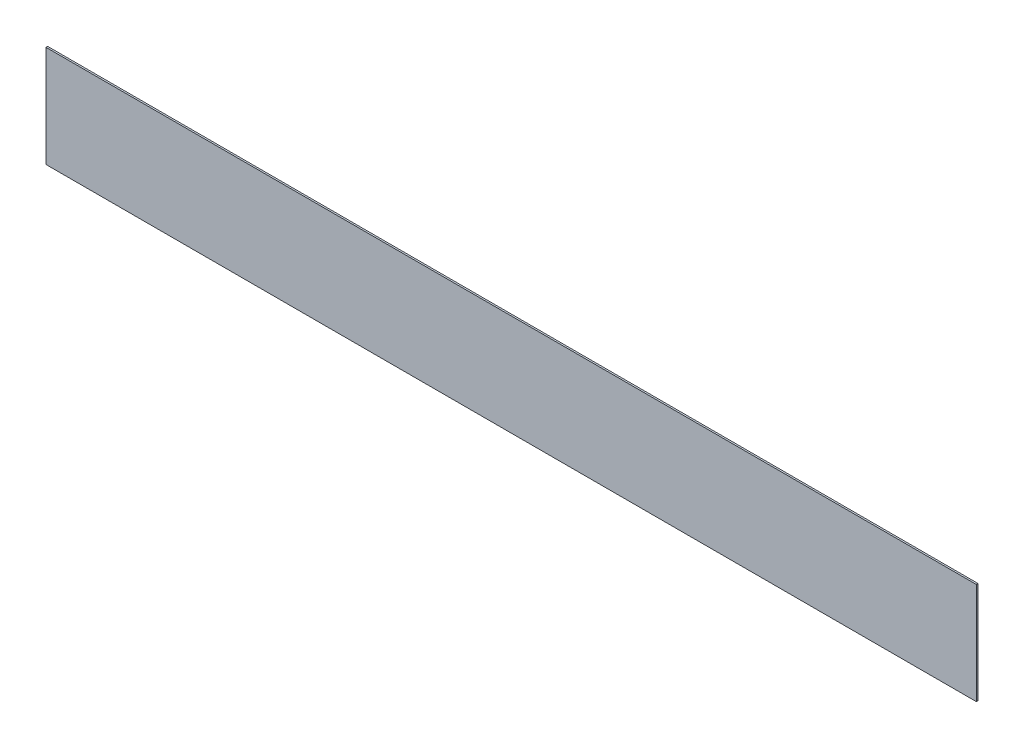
from build123d import *

# Parameters (mm, degrees)
EW_SKETCH_W      = 1
EW_SKETCH_H      = 60
EW_EXTRUDE_DEPTH = 550


with BuildPart() as part:
    # EW_SKETCH → EW_EXTRUDE (new body)
    with BuildSketch(Plane(origin=(0, 0, 0), x_dir=(0, 0, -1), z_dir=(1, 0, 0))):
        with Locations((-0.5, 0)):
            Rectangle(EW_SKETCH_W, EW_SKETCH_H)
    extrude(amount=EW_EXTRUDE_DEPTH)


solid = part.part
